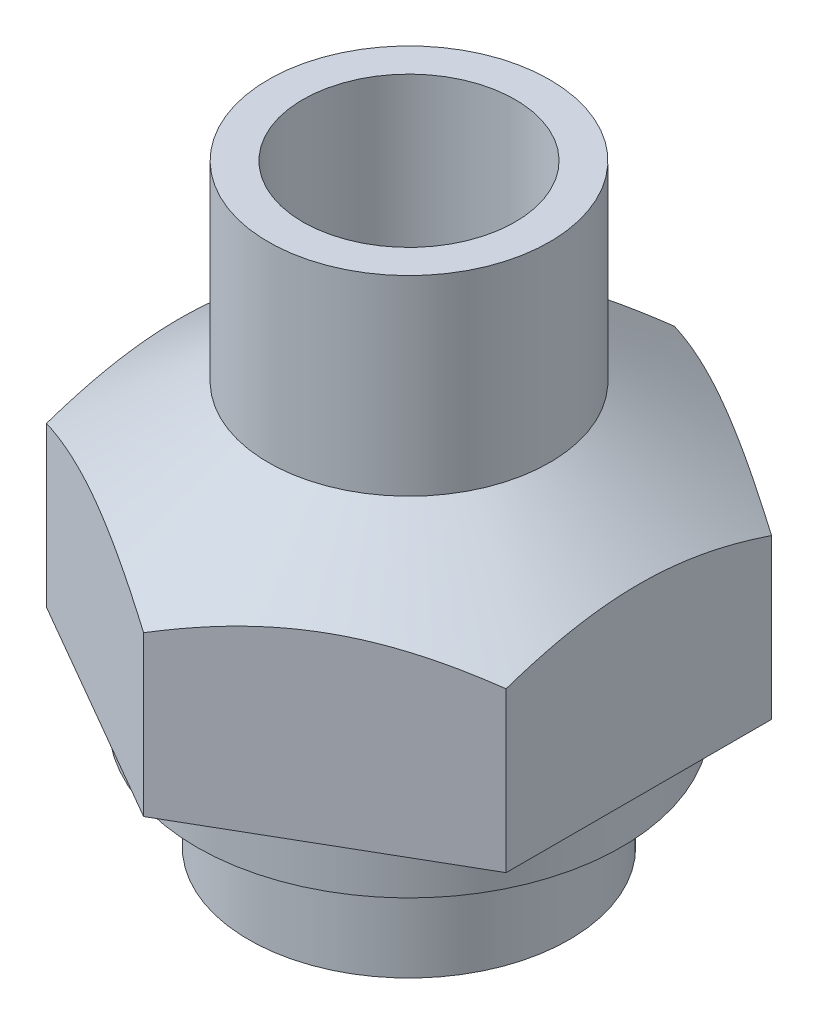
ISO-10303-21;
HEADER;
FILE_DESCRIPTION(('STEP AP214'),'2;1');
FILE_NAME('part.step','',(''),(''),'','','');
FILE_SCHEMA(('AUTOMOTIVE_DESIGN { 1 0 10303 214 1 1 1 1 }'));
ENDSEC;
DATA;
#1=APPLICATION_CONTEXT('core data for automotive mechanical design processes');
#2=APPLICATION_PROTOCOL_DEFINITION('international standard','automotive_design',2000,#1);
#3=PRODUCT_CONTEXT('',#1,'mechanical');
#4=PRODUCT('Part','Part','',(#3));
#5=PRODUCT_RELATED_PRODUCT_CATEGORY('part','',(#4));
#6=PRODUCT_DEFINITION_FORMATION('','',#4);
#7=PRODUCT_DEFINITION_CONTEXT('part definition',#1,'design');
#8=PRODUCT_DEFINITION('design','',#6,#7);
#9=PRODUCT_DEFINITION_SHAPE('','',#8);
#10=(LENGTH_UNIT() NAMED_UNIT(*) SI_UNIT(.MILLI.,.METRE.));
#11=(NAMED_UNIT(*) PLANE_ANGLE_UNIT() SI_UNIT($,.RADIAN.));
#12=(NAMED_UNIT(*) SI_UNIT($,.STERADIAN.) SOLID_ANGLE_UNIT());
#13=UNCERTAINTY_MEASURE_WITH_UNIT(LENGTH_MEASURE(1.E-05),#10,'distance_accuracy_value','');
#14=(GEOMETRIC_REPRESENTATION_CONTEXT(3) GLOBAL_UNCERTAINTY_ASSIGNED_CONTEXT((#13)) GLOBAL_UNIT_ASSIGNED_CONTEXT((#10,
#11,#12)) REPRESENTATION_CONTEXT('',''));
#15=CARTESIAN_POINT('',(0.,0.,0.));
#16=DIRECTION('',(0.,0.,1.));
#17=DIRECTION('',(1.,0.,0.));
#18=AXIS2_PLACEMENT_3D('',#15,#16,#17);
#19=CARTESIAN_POINT('',(0.,0.,0.));
#20=DIRECTION('',(0.,-1.,0.));
#21=DIRECTION('',(0.,0.,-1.));
#22=AXIS2_PLACEMENT_3D('',#19,#20,#21);
#23=CYLINDRICAL_SURFACE('',#22,14.);
#24=CARTESIAN_POINT('',(0.,8.,0.));
#25=DIRECTION('',(0.,-1.,0.));
#26=DIRECTION('',(0.,0.,-1.));
#27=AXIS2_PLACEMENT_3D('',#24,#25,#26);
#28=CIRCLE('',#27,14.);
#29=CARTESIAN_POINT('',(0.,8.,-14.));
#30=VERTEX_POINT('',#29);
#31=EDGE_CURVE('E277',#30,#30,#28,.F.);
#32=ORIENTED_EDGE('',*,*,#31,.T.);
#33=EDGE_LOOP('',(#32));
#34=FACE_BOUND('',#33,.T.);
#35=CARTESIAN_POINT('',(0.,10.,0.));
#36=DIRECTION('',(0.,-1.,0.));
#37=DIRECTION('',(0.,0.,-1.));
#38=AXIS2_PLACEMENT_3D('',#35,#36,#37);
#39=CIRCLE('',#38,14.);
#40=CARTESIAN_POINT('',(0.,10.,-14.));
#41=VERTEX_POINT('',#40);
#42=EDGE_CURVE('E19',#41,#41,#39,.T.);
#43=ORIENTED_EDGE('',*,*,#42,.T.);
#44=EDGE_LOOP('',(#43));
#45=FACE_BOUND('',#44,.T.);
#46=ADVANCED_FACE('F16',(#34,#45),#23,.T.);
#47=CARTESIAN_POINT('',(-14.,10.,0.));
#48=DIRECTION('',(0.,1.,0.));
#49=DIRECTION('',(0.,0.,1.));
#50=AXIS2_PLACEMENT_3D('',#47,#48,#49);
#51=PLANE('',#50);
#52=CARTESIAN_POINT('',(0.,10.,0.));
#53=DIRECTION('',(0.,-1.,0.));
#54=DIRECTION('',(0.,0.,-1.));
#55=AXIS2_PLACEMENT_3D('',#52,#53,#54);
#56=CIRCLE('',#55,20.);
#57=CARTESIAN_POINT('',(0.,10.,-20.));
#58=VERTEX_POINT('',#57);
#59=EDGE_CURVE('E275',#58,#58,#56,.F.);
#60=ORIENTED_EDGE('',*,*,#59,.F.);
#61=EDGE_LOOP('',(#60));
#62=FACE_BOUND('',#61,.T.);
#63=ORIENTED_EDGE('',*,*,#42,.F.);
#64=EDGE_LOOP('',(#63));
#65=FACE_BOUND('',#64,.T.);
#66=ADVANCED_FACE('F211',(#62,#65),#51,.F.);
#67=CARTESIAN_POINT('',(-15.1,8.,0.));
#68=DIRECTION('',(0.,-1.,0.));
#69=DIRECTION('',(0.,0.,-1.));
#70=AXIS2_PLACEMENT_3D('',#67,#68,#69);
#71=PLANE('',#70);
#72=ORIENTED_EDGE('',*,*,#31,.F.);
#73=EDGE_LOOP('',(#72));
#74=FACE_BOUND('',#73,.T.);
#75=CARTESIAN_POINT('',(0.,8.,0.));
#76=DIRECTION('',(0.,-1.,0.));
#77=DIRECTION('',(0.,0.,-1.));
#78=AXIS2_PLACEMENT_3D('',#75,#76,#77);
#79=CIRCLE('',#78,15.1);
#80=CARTESIAN_POINT('',(0.,8.,-15.1));
#81=VERTEX_POINT('',#80);
#82=EDGE_CURVE('E272',#81,#81,#79,.T.);
#83=ORIENTED_EDGE('',*,*,#82,.F.);
#84=EDGE_LOOP('',(#83));
#85=FACE_BOUND('',#84,.T.);
#86=ADVANCED_FACE('F208',(#74,#85),#71,.F.);
#87=CARTESIAN_POINT('',(0.,0.,0.));
#88=DIRECTION('',(0.,-1.,0.));
#89=DIRECTION('',(0.,0.,-1.));
#90=AXIS2_PLACEMENT_3D('',#87,#88,#89);
#91=CYLINDRICAL_SURFACE('',#90,20.);
#92=ORIENTED_EDGE('',*,*,#59,.T.);
#93=EDGE_LOOP('',(#92));
#94=FACE_BOUND('',#93,.T.);
#95=CARTESIAN_POINT('',(0.,15.,0.));
#96=DIRECTION('',(0.,-1.,0.));
#97=DIRECTION('',(0.,0.,-1.));
#98=AXIS2_PLACEMENT_3D('',#95,#96,#97);
#99=CIRCLE('',#98,20.);
#100=CARTESIAN_POINT('',(0.,15.,-20.));
#101=VERTEX_POINT('',#100);
#102=EDGE_CURVE('E269',#101,#101,#99,.T.);
#103=ORIENTED_EDGE('',*,*,#102,.T.);
#104=EDGE_LOOP('',(#103));
#105=FACE_BOUND('',#104,.T.);
#106=ADVANCED_FACE('F204',(#94,#105),#91,.T.);
#107=CARTESIAN_POINT('',(0.,0.,0.));
#108=DIRECTION('',(0.,-1.,0.));
#109=DIRECTION('',(0.,0.,-1.));
#110=AXIS2_PLACEMENT_3D('',#107,#108,#109);
#111=CYLINDRICAL_SURFACE('',#110,15.1);
#112=CARTESIAN_POINT('',(0.,0.,0.));
#113=DIRECTION('',(0.,-1.,0.));
#114=DIRECTION('',(0.,0.,-1.));
#115=AXIS2_PLACEMENT_3D('',#112,#113,#114);
#116=CIRCLE('',#115,15.1);
#117=CARTESIAN_POINT('',(0.,0.,-15.1));
#118=VERTEX_POINT('',#117);
#119=EDGE_CURVE('E266',#118,#118,#116,.F.);
#120=ORIENTED_EDGE('',*,*,#119,.T.);
#121=EDGE_LOOP('',(#120));
#122=FACE_BOUND('',#121,.T.);
#123=ORIENTED_EDGE('',*,*,#82,.T.);
#124=EDGE_LOOP('',(#123));
#125=FACE_BOUND('',#124,.T.);
#126=ADVANCED_FACE('F201',(#122,#125),#111,.T.);
#127=CARTESIAN_POINT('',(-20.,15.,0.));
#128=DIRECTION('',(0.,1.,0.));
#129=DIRECTION('',(0.,0.,1.));
#130=AXIS2_PLACEMENT_3D('',#127,#128,#129);
#131=PLANE('',#130);
#132=DIRECTION('',(0.866025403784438,0.,0.500000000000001));
#133=VECTOR('',#132,1.);
#134=CARTESIAN_POINT('',(0.,15.,25.));
#135=LINE('',#134,#133);
#136=CARTESIAN_POINT('',(-21.650635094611,15.,12.4999999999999));
#137=VERTEX_POINT('',#136);
#138=CARTESIAN_POINT('',(0.,15.,25.));
#139=VERTEX_POINT('',#138);
#140=EDGE_CURVE('E104',#137,#139,#135,.T.);
#141=ORIENTED_EDGE('',*,*,#140,.F.);
#142=DIRECTION('',(0.,0.,1.));
#143=VECTOR('',#142,1.);
#144=CARTESIAN_POINT('',(-21.650635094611,15.,12.4999999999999));
#145=LINE('',#144,#143);
#146=CARTESIAN_POINT('',(-21.6506350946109,15.,-12.5000000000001));
#147=VERTEX_POINT('',#146);
#148=EDGE_CURVE('E109',#147,#137,#145,.T.);
#149=ORIENTED_EDGE('',*,*,#148,.F.);
#150=DIRECTION('',(-0.866025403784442,0.,0.499999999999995));
#151=VECTOR('',#150,1.);
#152=CARTESIAN_POINT('',(-21.6506350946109,15.,-12.5000000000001));
#153=LINE('',#152,#151);
#154=CARTESIAN_POINT('',(1.74206827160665E-13,15.,-25.));
#155=VERTEX_POINT('',#154);
#156=EDGE_CURVE('E87',#155,#147,#153,.T.);
#157=ORIENTED_EDGE('',*,*,#156,.F.);
#158=DIRECTION('',(-0.866025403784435,0.,-0.500000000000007));
#159=VECTOR('',#158,1.);
#160=CARTESIAN_POINT('',(1.74574066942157E-13,15.,-25.));
#161=LINE('',#160,#159);
#162=CARTESIAN_POINT('',(21.6506350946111,15.,-12.4999999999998));
#163=VERTEX_POINT('',#162);
#164=EDGE_CURVE('E79',#163,#155,#161,.T.);
#165=ORIENTED_EDGE('',*,*,#164,.F.);
#166=DIRECTION('',(0.,0.,-1.));
#167=VECTOR('',#166,1.);
#168=CARTESIAN_POINT('',(21.6506350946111,15.,-12.4999999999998));
#169=LINE('',#168,#167);
#170=CARTESIAN_POINT('',(21.6506350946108,15.,12.5000000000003));
#171=VERTEX_POINT('',#170);
#172=EDGE_CURVE('E67',#171,#163,#169,.T.);
#173=ORIENTED_EDGE('',*,*,#172,.F.);
#174=DIRECTION('',(0.866025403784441,0.,-0.499999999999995));
#175=VECTOR('',#174,1.);
#176=CARTESIAN_POINT('',(21.6506350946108,15.,12.5000000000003));
#177=LINE('',#176,#175);
#178=EDGE_CURVE('E99',#139,#171,#177,.T.);
#179=ORIENTED_EDGE('',*,*,#178,.F.);
#180=EDGE_LOOP('',(#141,#149,#157,#165,#173,#179));
#181=FACE_BOUND('',#180,.T.);
#182=ORIENTED_EDGE('',*,*,#102,.F.);
#183=EDGE_LOOP('',(#182));
#184=FACE_BOUND('',#183,.T.);
#185=ADVANCED_FACE('F84',(#181,#184),#131,.F.);
#186=CARTESIAN_POINT('',(0.,0.,0.));
#187=DIRECTION('',(0.,1.,0.));
#188=DIRECTION('',(0.,0.,1.));
#189=AXIS2_PLACEMENT_3D('',#186,#187,#188);
#190=PLANE('',#189);
#191=ORIENTED_EDGE('',*,*,#119,.F.);
#192=EDGE_LOOP('',(#191));
#193=FACE_BOUND('',#192,.T.);
#194=CARTESIAN_POINT('',(0.,0.,0.));
#195=DIRECTION('',(0.,-1.,0.));
#196=DIRECTION('',(0.,0.,-1.));
#197=AXIS2_PLACEMENT_3D('',#194,#195,#196);
#198=CIRCLE('',#197,11.);
#199=CARTESIAN_POINT('',(0.,0.,-11.));
#200=VERTEX_POINT('',#199);
#201=EDGE_CURVE('E89',#200,#200,#198,.F.);
#202=ORIENTED_EDGE('',*,*,#201,.T.);
#203=EDGE_LOOP('',(#202));
#204=FACE_BOUND('',#203,.T.);
#205=ADVANCED_FACE('F194',(#193,#204),#190,.F.);
#206=CARTESIAN_POINT('',(-21.6506350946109,45.,-12.5000000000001));
#207=DIRECTION('',(-0.499999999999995,0.,-0.866025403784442));
#208=DIRECTION('',(-0.866025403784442,0.,0.499999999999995));
#209=AXIS2_PLACEMENT_3D('',#206,#207,#208);
#210=PLANE('',#209);
#211=ORIENTED_EDGE('',*,*,#156,.T.);
#212=DIRECTION('',(0.,1.,0.));
#213=VECTOR('',#212,1.);
#214=CARTESIAN_POINT('',(-21.6506350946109,45.,-12.5000000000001));
#215=LINE('',#214,#213);
#216=CARTESIAN_POINT('',(-21.6506350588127,30.0000000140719,-12.5000000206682));
#217=VERTEX_POINT('',#216);
#218=EDGE_CURVE('E111',#217,#147,#215,.F.);
#219=ORIENTED_EDGE('',*,*,#218,.F.);
#220=CARTESIAN_POINT('',(1.1179479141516E-13,30.,-25.));
#221=CARTESIAN_POINT('',(-0.241893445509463,30.0950837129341,-24.8603427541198));
#222=CARTESIAN_POINT('',(-0.484415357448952,30.1880283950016,-24.7203226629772));
#223=CARTESIAN_POINT('',(-0.970728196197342,30.3693135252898,-24.4395498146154));
#224=CARTESIAN_POINT('',(-1.21451903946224,30.4576542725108,-24.2987971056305));
#225=CARTESIAN_POINT('',(-1.94811192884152,30.7153879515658,-23.8752570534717));
#226=CARTESIAN_POINT('',(-2.4398854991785,30.8773938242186,-23.5913314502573));
#227=CARTESIAN_POINT('',(-3.43032328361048,31.1794377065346,-23.0195019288));
#228=CARTESIAN_POINT('',(-3.92900554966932,31.3193971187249,-22.7315875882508));
#229=CARTESIAN_POINT('',(-4.93122843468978,31.5737487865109,-22.1529539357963));
#230=CARTESIAN_POINT('',(-5.43476860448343,31.6881433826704,-21.8622348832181));
#231=CARTESIAN_POINT('',(-6.42868892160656,31.8851412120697,-21.288394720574));
#232=CARTESIAN_POINT('',(-6.91892568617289,31.9687029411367,-21.005356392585));
#233=CARTESIAN_POINT('',(-7.90246060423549,32.1072377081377,-20.4375122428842));
#234=CARTESIAN_POINT('',(-8.39575884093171,32.1622099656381,-20.1527063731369));
#235=CARTESIAN_POINT('',(-9.38329231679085,32.2419216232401,-19.5825536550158));
#236=CARTESIAN_POINT('',(-9.87752420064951,32.2667160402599,-19.2972087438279));
#237=CARTESIAN_POINT('',(-10.8664139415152,32.2855049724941,-18.7262729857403));
#238=CARTESIAN_POINT('',(-11.3610717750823,32.2795010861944,-18.4406821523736));
#239=CARTESIAN_POINT('',(-12.2664003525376,32.2404718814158,-17.9179904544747));
#240=CARTESIAN_POINT('',(-12.6772296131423,32.2121521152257,-17.6807980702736));
#241=CARTESIAN_POINT('',(-13.4974190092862,32.1349203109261,-17.2072615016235));
#242=CARTESIAN_POINT('',(-13.9067791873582,32.0860088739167,-16.9709172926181));
#243=CARTESIAN_POINT('',(-14.7238964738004,31.9684649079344,-16.4991544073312));
#244=CARTESIAN_POINT('',(-15.131650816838,31.8998069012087,-16.2637373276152));
#245=CARTESIAN_POINT('',(-15.9444880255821,31.7440348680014,-15.7944455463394));
#246=CARTESIAN_POINT('',(-16.349570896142,31.6569208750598,-15.5605708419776));
#247=CARTESIAN_POINT('',(-17.5842624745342,31.3643069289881,-14.8477213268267));
#248=CARTESIAN_POINT('',(-18.4089594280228,31.1311622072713,-14.3715823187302));
#249=CARTESIAN_POINT('',(-20.0418644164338,30.6062567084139,-13.42882418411));
#250=CARTESIAN_POINT('',(-20.8501121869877,30.31466204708,-12.9621821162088));
#251=CARTESIAN_POINT('',(-21.6506350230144,30.0000000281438,-12.5000000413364));
#252=B_SPLINE_CURVE_WITH_KNOTS('',3,(#220,#221,#222,#223,#224,#225,#226,#227,#228,#229,#230,
#231,#232,#233,#234,#235,#236,#237,#238,#239,#240,#241,#242,#243,#244,#245,#246,#247,#248,#249,
#250,#251),.UNSPECIFIED.,.F.,.F.,(4,2,2,2,2,2,2,2,2,2,2,2,2,2,2,4),(0.,0.885148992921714,
1.77024042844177,3.54133406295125,5.31860546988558,7.09571409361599,8.81167213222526,
10.5276770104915,12.2405487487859,13.9533315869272,15.3785734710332,16.8037737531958,
18.2308211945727,19.6578660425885,22.5967828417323,25.5274626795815),.UNSPECIFIED.);
#253=CARTESIAN_POINT('',(1.14054863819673E-13,30.,-25.));
#254=VERTEX_POINT('',#253);
#255=EDGE_CURVE('E179',#254,#217,#252,.T.);
#256=ORIENTED_EDGE('',*,*,#255,.F.);
#257=DIRECTION('',(0.,1.,0.));
#258=VECTOR('',#257,1.);
#259=CARTESIAN_POINT('',(1.74574066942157E-13,45.,-25.));
#260=LINE('',#259,#258);
#261=EDGE_CURVE('E33',#155,#254,#260,.T.);
#262=ORIENTED_EDGE('',*,*,#261,.F.);
#263=EDGE_LOOP('',(#211,#219,#256,#262));
#264=FACE_BOUND('',#263,.T.);
#265=ADVANCED_FACE('F189',(#264),#210,.T.);
#266=CARTESIAN_POINT('',(-21.650635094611,45.,12.4999999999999));
#267=DIRECTION('',(-1.,0.,0.));
#268=DIRECTION('',(0.,0.,1.));
#269=AXIS2_PLACEMENT_3D('',#266,#267,#268);
#270=PLANE('',#269);
#271=ORIENTED_EDGE('',*,*,#148,.T.);
#272=DIRECTION('',(0.,1.,0.));
#273=VECTOR('',#272,1.);
#274=CARTESIAN_POINT('',(-21.650635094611,45.,12.4999999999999));
#275=LINE('',#274,#273);
#276=CARTESIAN_POINT('',(-21.650635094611,30.0000000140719,12.4999999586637));
#277=VERTEX_POINT('',#276);
#278=EDGE_CURVE('E106',#277,#137,#275,.F.);
#279=ORIENTED_EDGE('',*,*,#278,.F.);
#280=CARTESIAN_POINT('',(-21.6506350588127,29.9999999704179,-12.500000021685));
#281=CARTESIAN_POINT('',(-21.6506350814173,30.0950836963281,-12.2206855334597));
#282=CARTESIAN_POINT('',(-21.6506350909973,30.1880283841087,-11.940645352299));
#283=CARTESIAN_POINT('',(-21.6506350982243,30.3693135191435,-11.3790996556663));
#284=CARTESIAN_POINT('',(-21.650635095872,30.4576542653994,-11.0975942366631));
#285=CARTESIAN_POINT('',(-21.6506350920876,30.7153879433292,-10.2505141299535));
#286=CARTESIAN_POINT('',(-21.6506350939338,30.8773938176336,-9.68266292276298));
#287=CARTESIAN_POINT('',(-21.6506350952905,31.1794377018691,-8.53900387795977));
#288=CARTESIAN_POINT('',(-21.6506350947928,31.3193971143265,-7.96317519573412));
#289=CARTESIAN_POINT('',(-21.6506350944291,31.5737487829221,-6.80590788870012));
#290=CARTESIAN_POINT('',(-21.650635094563,31.6881433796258,-6.22446978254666));
#291=CARTESIAN_POINT('',(-21.6506350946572,31.8851412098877,-5.07678945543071));
#292=CARTESIAN_POINT('',(-21.6506350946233,31.9687029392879,-4.51071279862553));
#293=CARTESIAN_POINT('',(-21.6506350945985,32.1072377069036,-3.37502449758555));
#294=CARTESIAN_POINT('',(-21.6506350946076,32.1622099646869,-2.80541275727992));
#295=CARTESIAN_POINT('',(-21.6506350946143,32.2419216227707,-1.66510731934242));
#296=CARTESIAN_POINT('',(-21.6506350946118,32.2667160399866,-1.09441749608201));
#297=CARTESIAN_POINT('',(-21.6506350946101,32.2855049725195,0.0474540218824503));
#298=CARTESIAN_POINT('',(-21.6506350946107,32.2795010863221,0.618635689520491));
#299=CARTESIAN_POINT('',(-21.6506350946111,32.2404718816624,1.66401908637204));
#300=CARTESIAN_POINT('',(-21.650635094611,32.2121521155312,2.13840385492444));
#301=CARTESIAN_POINT('',(-21.6506350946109,32.1349203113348,3.08547699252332));
#302=CARTESIAN_POINT('',(-21.650635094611,32.0860088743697,3.5581654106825));
#303=CARTESIAN_POINT('',(-21.650635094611,31.9684649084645,4.50169118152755));
#304=CARTESIAN_POINT('',(-21.650635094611,31.8998069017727,4.9725253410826));
#305=CARTESIAN_POINT('',(-21.650635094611,31.7440348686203,5.911108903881));
#306=CARTESIAN_POINT('',(-21.650635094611,31.6569208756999,6.37885831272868));
#307=CARTESIAN_POINT('',(-21.650635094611,31.3643069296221,7.80455734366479));
#308=CARTESIAN_POINT('',(-21.650635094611,31.1311622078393,8.75683536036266));
#309=CARTESIAN_POINT('',(-21.650635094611,30.6062567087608,10.6423516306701));
#310=CARTESIAN_POINT('',(-21.650635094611,30.3146620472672,11.5756357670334));
#311=CARTESIAN_POINT('',(-21.650635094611,30.0000000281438,12.4999999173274));
#312=B_SPLINE_CURVE_WITH_KNOTS('',3,(#280,#281,#282,#283,#284,#285,#286,#287,#288,#289,#290,
#291,#292,#293,#294,#295,#296,#297,#298,#299,#300,#301,#302,#303,#304,#305,#306,#307,#308,#309,
#310,#311),.UNSPECIFIED.,.F.,.F.,(4,2,2,2,2,2,2,2,2,2,2,2,2,2,2,4),(0.,0.885148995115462,
1.77024043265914,3.54133407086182,5.31860548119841,7.0957141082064,8.81167214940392,
10.527677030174,12.2405487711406,13.9533316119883,15.3785734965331,16.8037737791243,
18.2308212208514,19.6578660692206,22.5967828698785,25.5274627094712),.UNSPECIFIED.);
#313=EDGE_CURVE('E173',#217,#277,#312,.T.);
#314=ORIENTED_EDGE('',*,*,#313,.F.);
#315=ORIENTED_EDGE('',*,*,#218,.T.);
#316=EDGE_LOOP('',(#271,#279,#314,#315));
#317=FACE_BOUND('',#316,.T.);
#318=ADVANCED_FACE('F186',(#317),#270,.T.);
#319=CARTESIAN_POINT('',(0.,45.,25.));
#320=DIRECTION('',(-0.500000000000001,0.,0.866025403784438));
#321=DIRECTION('',(0.866025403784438,0.,0.500000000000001));
#322=AXIS2_PLACEMENT_3D('',#319,#320,#321);
#323=PLANE('',#322);
#324=ORIENTED_EDGE('',*,*,#140,.T.);
#325=DIRECTION('',(0.,1.,0.));
#326=VECTOR('',#325,1.);
#327=CARTESIAN_POINT('',(0.,45.,25.));
#328=LINE('',#327,#326);
#329=CARTESIAN_POINT('',(0.,30.,25.));
#330=VERTEX_POINT('',#329);
#331=EDGE_CURVE('E101',#330,#139,#328,.F.);
#332=ORIENTED_EDGE('',*,*,#331,.F.);
#333=CARTESIAN_POINT('',(-21.6506350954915,29.9999999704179,12.4999999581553));
#334=CARTESIAN_POINT('',(-21.408741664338,30.0950836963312,12.6396572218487));
#335=CARTESIAN_POINT('',(-21.1662197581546,30.1880283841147,12.77967732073));
#336=CARTESIAN_POINT('',(-20.6799069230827,30.369313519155,13.0604501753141));
#337=CARTESIAN_POINT('',(-20.4361160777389,30.4576542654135,13.2012028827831));
#338=CARTESIAN_POINT('',(-19.702523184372,30.7153879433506,13.6247429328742));
#339=CARTESIAN_POINT('',(-19.2107496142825,30.8773938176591,13.9086685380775));
#340=CARTESIAN_POINT('',(-18.2203118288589,31.1794377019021,14.480498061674));
#341=CARTESIAN_POINT('',(-17.7216295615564,31.3193971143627,14.7684124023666));
#342=CARTESIAN_POINT('',(-16.7194066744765,31.5737487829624,15.3470460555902));
#343=CARTESIAN_POINT('',(-16.2158665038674,31.6881433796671,15.6377651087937));
#344=CARTESIAN_POINT('',(-15.2219461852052,31.8851412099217,16.2116052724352));
#345=CARTESIAN_POINT('',(-14.7317094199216,31.9687029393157,16.4946436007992));
#346=CARTESIAN_POINT('',(-13.7481745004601,32.1072377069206,17.0624877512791));
#347=CARTESIAN_POINT('',(-13.2548762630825,32.1622099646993,17.3472936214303));
#348=CARTESIAN_POINT('',(-12.2673427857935,32.2419216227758,17.9174463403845));
#349=CARTESIAN_POINT('',(-11.7731109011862,32.266716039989,18.2027912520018));
#350=CARTESIAN_POINT('',(-10.7842211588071,32.2855049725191,18.7737270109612));
#351=CARTESIAN_POINT('',(-10.2895633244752,32.2795010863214,19.0593178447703));
#352=CARTESIAN_POINT('',(-9.38423474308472,32.2404718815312,19.5820095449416));
#353=CARTESIAN_POINT('',(-8.97340547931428,32.2121521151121,19.8192019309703));
#354=CARTESIAN_POINT('',(-8.15321607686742,32.1349203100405,20.2927385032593));
#355=CARTESIAN_POINT('',(-7.74385589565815,32.086008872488,20.5290827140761));
#356=CARTESIAN_POINT('',(-6.92673860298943,31.9684649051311,21.0008456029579));
#357=CARTESIAN_POINT('',(-6.51898425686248,31.8998068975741,21.2362626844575));
#358=CARTESIAN_POINT('',(-5.7061470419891,31.7440348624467,21.705554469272));
#359=CARTESIAN_POINT('',(-5.30106416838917,31.6569208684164,21.939429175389));
#360=CARTESIAN_POINT('',(-4.06637258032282,31.3643069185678,22.6522786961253));
#361=CARTESIAN_POINT('',(-3.24167562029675,31.1311621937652,23.1284177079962));
#362=CARTESIAN_POINT('',(-1.60877061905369,30.6062566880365,24.071175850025));
#363=CARTESIAN_POINT('',(-0.80052284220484,30.3146620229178,24.5378179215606));
#364=CARTESIAN_POINT('',(0.,30.,25.));
#365=B_SPLINE_CURVE_WITH_KNOTS('',3,(#333,#334,#335,#336,#337,#338,#339,#340,#341,#342,#343,
#344,#345,#346,#347,#348,#349,#350,#351,#352,#353,#354,#355,#356,#357,#358,#359,#360,#361,#362,
#363,#364),.UNSPECIFIED.,.F.,.F.,(4,2,2,2,2,2,2,2,2,2,2,2,2,2,2,4),(0.,0.88514899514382,
1.77024043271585,3.54133407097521,5.31860548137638,7.09571410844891,8.81167214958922,
10.5276770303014,12.240548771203,13.9533316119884,15.3785735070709,16.8037738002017,
18.2308212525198,19.6578661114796,22.5967829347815,25.5274627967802),.UNSPECIFIED.);
#366=EDGE_CURVE('E167',#277,#330,#365,.T.);
#367=ORIENTED_EDGE('',*,*,#366,.F.);
#368=ORIENTED_EDGE('',*,*,#278,.T.);
#369=EDGE_LOOP('',(#324,#332,#367,#368));
#370=FACE_BOUND('',#369,.T.);
#371=ADVANCED_FACE('F157',(#370),#323,.T.);
#372=CARTESIAN_POINT('',(21.6506350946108,45.,12.5000000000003));
#373=DIRECTION('',(0.499999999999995,0.,0.866025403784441));
#374=DIRECTION('',(0.866025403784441,0.,-0.499999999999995));
#375=AXIS2_PLACEMENT_3D('',#372,#373,#374);
#376=PLANE('',#375);
#377=ORIENTED_EDGE('',*,*,#178,.T.);
#378=DIRECTION('',(0.,1.,0.));
#379=VECTOR('',#378,1.);
#380=CARTESIAN_POINT('',(21.6506350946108,45.,12.5000000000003));
#381=LINE('',#380,#379);
#382=CARTESIAN_POINT('',(21.6506350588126,30.0000000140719,12.5000000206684));
#383=VERTEX_POINT('',#382);
#384=EDGE_CURVE('E73',#383,#171,#381,.F.);
#385=ORIENTED_EDGE('',*,*,#384,.F.);
#386=CARTESIAN_POINT('',(0.,30.,25.));
#387=CARTESIAN_POINT('',(0.241893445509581,30.0950837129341,24.8603427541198));
#388=CARTESIAN_POINT('',(0.484415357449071,30.1880283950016,24.7203226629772));
#389=CARTESIAN_POINT('',(0.970728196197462,30.3693135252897,24.4395498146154));
#390=CARTESIAN_POINT('',(1.21451903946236,30.4576542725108,24.2987971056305));
#391=CARTESIAN_POINT('',(1.94811192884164,30.7153879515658,23.8752570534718));
#392=CARTESIAN_POINT('',(2.43988549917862,30.8773938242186,23.5913314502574));
#393=CARTESIAN_POINT('',(3.43032328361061,31.1794377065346,23.0195019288));
#394=CARTESIAN_POINT('',(3.92900554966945,31.3193971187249,22.7315875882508));
#395=CARTESIAN_POINT('',(4.93122843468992,31.5737487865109,22.1529539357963));
#396=CARTESIAN_POINT('',(5.43476860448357,31.6881433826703,21.8622348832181));
#397=CARTESIAN_POINT('',(6.4286889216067,31.8851412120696,21.2883947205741));
#398=CARTESIAN_POINT('',(6.91892568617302,31.9687029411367,21.005356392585));
#399=CARTESIAN_POINT('',(7.90246060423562,32.1072377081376,20.4375122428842));
#400=CARTESIAN_POINT('',(8.39575884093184,32.162209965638,20.1527063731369));
#401=CARTESIAN_POINT('',(9.38329231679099,32.24192162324,19.5825536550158));
#402=CARTESIAN_POINT('',(9.87752420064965,32.2667160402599,19.297208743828));
#403=CARTESIAN_POINT('',(10.8664139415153,32.285504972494,18.7262729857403));
#404=CARTESIAN_POINT('',(11.3610717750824,32.2795010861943,18.4406821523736));
#405=CARTESIAN_POINT('',(12.2664003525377,32.2404718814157,17.9179904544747));
#406=CARTESIAN_POINT('',(12.6772296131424,32.2121521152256,17.6807980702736));
#407=CARTESIAN_POINT('',(13.4974190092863,32.1349203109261,17.2072615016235));
#408=CARTESIAN_POINT('',(13.9067791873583,32.0860088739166,16.9709172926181));
#409=CARTESIAN_POINT('',(14.7238964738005,31.9684649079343,16.4991544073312));
#410=CARTESIAN_POINT('',(15.1316508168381,31.8998069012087,16.2637373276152));
#411=CARTESIAN_POINT('',(15.9444880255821,31.7440348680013,15.7944455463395));
#412=CARTESIAN_POINT('',(16.3495708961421,31.6569208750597,15.5605708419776));
#413=CARTESIAN_POINT('',(17.5842624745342,31.3643069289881,14.8477213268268));
#414=CARTESIAN_POINT('',(18.4089594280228,31.1311622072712,14.3715823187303));
#415=CARTESIAN_POINT('',(20.0418644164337,30.6062567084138,13.4288241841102));
#416=CARTESIAN_POINT('',(20.8501121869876,30.31466204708,12.962182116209));
#417=CARTESIAN_POINT('',(21.6506350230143,30.0000000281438,12.5000000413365));
#418=B_SPLINE_CURVE_WITH_KNOTS('',3,(#386,#387,#388,#389,#390,#391,#392,#393,#394,#395,#396,
#397,#398,#399,#400,#401,#402,#403,#404,#405,#406,#407,#408,#409,#410,#411,#412,#413,#414,#415,
#416,#417),.UNSPECIFIED.,.F.,.F.,(4,2,2,2,2,2,2,2,2,2,2,2,2,2,2,4),(0.,0.885148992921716,
1.77024042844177,3.54133406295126,5.31860546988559,7.095714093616,8.81167213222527,
10.5276770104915,12.240548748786,13.9533315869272,15.3785734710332,16.8037737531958,
18.2308211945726,19.6578660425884,22.5967828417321,25.5274626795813),.UNSPECIFIED.);
#419=EDGE_CURVE('E161',#330,#383,#418,.T.);
#420=ORIENTED_EDGE('',*,*,#419,.F.);
#421=ORIENTED_EDGE('',*,*,#331,.T.);
#422=EDGE_LOOP('',(#377,#385,#420,#421));
#423=FACE_BOUND('',#422,.T.);
#424=ADVANCED_FACE('F153',(#423),#376,.T.);
#425=CARTESIAN_POINT('',(21.6506350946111,45.,-12.4999999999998));
#426=DIRECTION('',(1.,0.,0.));
#427=DIRECTION('',(0.,0.,-1.));
#428=AXIS2_PLACEMENT_3D('',#425,#426,#427);
#429=PLANE('',#428);
#430=ORIENTED_EDGE('',*,*,#172,.T.);
#431=DIRECTION('',(0.,1.,0.));
#432=VECTOR('',#431,1.);
#433=CARTESIAN_POINT('',(21.6506350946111,45.,-12.4999999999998));
#434=LINE('',#433,#432);
#435=CARTESIAN_POINT('',(21.6506350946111,30.0000000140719,-12.4999999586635));
#436=VERTEX_POINT('',#435);
#437=EDGE_CURVE('E71',#436,#163,#434,.F.);
#438=ORIENTED_EDGE('',*,*,#437,.F.);
#439=CARTESIAN_POINT('',(21.6506350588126,29.9999999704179,12.5000000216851));
#440=CARTESIAN_POINT('',(21.6506350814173,30.0950836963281,12.2206855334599));
#441=CARTESIAN_POINT('',(21.6506350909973,30.1880283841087,11.9406453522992));
#442=CARTESIAN_POINT('',(21.6506350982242,30.3693135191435,11.3790996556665));
#443=CARTESIAN_POINT('',(21.6506350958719,30.4576542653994,11.0975942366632));
#444=CARTESIAN_POINT('',(21.6506350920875,30.7153879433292,10.2505141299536));
#445=CARTESIAN_POINT('',(21.6506350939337,30.8773938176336,9.68266292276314));
#446=CARTESIAN_POINT('',(21.6506350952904,31.1794377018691,8.53900387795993));
#447=CARTESIAN_POINT('',(21.6506350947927,31.3193971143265,7.96317519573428));
#448=CARTESIAN_POINT('',(21.650635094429,31.5737487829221,6.80590788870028));
#449=CARTESIAN_POINT('',(21.650635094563,31.6881433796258,6.22446978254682));
#450=CARTESIAN_POINT('',(21.6506350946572,31.8851412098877,5.07678945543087));
#451=CARTESIAN_POINT('',(21.6506350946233,31.9687029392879,4.51071279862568));
#452=CARTESIAN_POINT('',(21.6506350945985,32.1072377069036,3.37502449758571));
#453=CARTESIAN_POINT('',(21.6506350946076,32.1622099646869,2.80541275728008));
#454=CARTESIAN_POINT('',(21.6506350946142,32.2419216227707,1.66510731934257));
#455=CARTESIAN_POINT('',(21.6506350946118,32.2667160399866,1.09441749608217));
#456=CARTESIAN_POINT('',(21.6506350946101,32.2855049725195,-0.0474540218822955));
#457=CARTESIAN_POINT('',(21.6506350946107,32.279501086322,-0.618635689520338));
#458=CARTESIAN_POINT('',(21.6506350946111,32.2404718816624,-1.66401908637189));
#459=CARTESIAN_POINT('',(21.650635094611,32.2121521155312,-2.13840385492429));
#460=CARTESIAN_POINT('',(21.6506350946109,32.1349203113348,-3.08547699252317));
#461=CARTESIAN_POINT('',(21.650635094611,32.0860088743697,-3.55816541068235));
#462=CARTESIAN_POINT('',(21.650635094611,31.9684649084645,-4.50169118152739));
#463=CARTESIAN_POINT('',(21.650635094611,31.8998069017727,-4.97252534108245));
#464=CARTESIAN_POINT('',(21.650635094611,31.7440348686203,-5.91110890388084));
#465=CARTESIAN_POINT('',(21.650635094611,31.6569208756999,-6.37885831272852));
#466=CARTESIAN_POINT('',(21.650635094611,31.3643069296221,-7.80455734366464));
#467=CARTESIAN_POINT('',(21.650635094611,31.1311622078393,-8.75683536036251));
#468=CARTESIAN_POINT('',(21.6506350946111,30.6062567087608,-10.6423516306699));
#469=CARTESIAN_POINT('',(21.6506350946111,30.3146620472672,-11.5756357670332));
#470=CARTESIAN_POINT('',(21.6506350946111,30.0000000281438,-12.4999999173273));
#471=B_SPLINE_CURVE_WITH_KNOTS('',3,(#439,#440,#441,#442,#443,#444,#445,#446,#447,#448,#449,
#450,#451,#452,#453,#454,#455,#456,#457,#458,#459,#460,#461,#462,#463,#464,#465,#466,#467,#468,
#469,#470),.UNSPECIFIED.,.F.,.F.,(4,2,2,2,2,2,2,2,2,2,2,2,2,2,2,4),(0.,0.88514899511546,
1.77024043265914,3.54133407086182,5.31860548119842,7.0957141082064,8.81167214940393,
10.527677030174,12.2405487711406,13.9533316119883,15.3785734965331,16.8037737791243,
18.2308212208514,19.6578660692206,22.5967828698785,25.5274627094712),.UNSPECIFIED.);
#472=EDGE_CURVE('E136',#383,#436,#471,.T.);
#473=ORIENTED_EDGE('',*,*,#472,.F.);
#474=ORIENTED_EDGE('',*,*,#384,.T.);
#475=EDGE_LOOP('',(#430,#438,#473,#474));
#476=FACE_BOUND('',#475,.T.);
#477=ADVANCED_FACE('F69',(#476),#429,.T.);
#478=CARTESIAN_POINT('',(1.74574066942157E-13,45.,-25.));
#479=DIRECTION('',(0.500000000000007,0.,-0.866025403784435));
#480=DIRECTION('',(-0.866025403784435,0.,-0.500000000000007));
#481=AXIS2_PLACEMENT_3D('',#478,#479,#480);
#482=PLANE('',#481);
#483=ORIENTED_EDGE('',*,*,#164,.T.);
#484=ORIENTED_EDGE('',*,*,#261,.T.);
#485=CARTESIAN_POINT('',(21.6506350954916,29.9999999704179,-12.4999999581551));
#486=CARTESIAN_POINT('',(21.4087416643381,30.0950836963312,-12.6396572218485));
#487=CARTESIAN_POINT('',(21.1662197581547,30.1880283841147,-12.7796773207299));
#488=CARTESIAN_POINT('',(20.6799069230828,30.369313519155,-13.0604501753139));
#489=CARTESIAN_POINT('',(20.436116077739,30.4576542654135,-13.201202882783));
#490=CARTESIAN_POINT('',(19.7025231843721,30.7153879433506,-13.6247429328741));
#491=CARTESIAN_POINT('',(19.2107496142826,30.8773938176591,-13.9086685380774));
#492=CARTESIAN_POINT('',(18.220311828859,31.1794377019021,-14.4804980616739));
#493=CARTESIAN_POINT('',(17.7216295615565,31.3193971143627,-14.7684124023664));
#494=CARTESIAN_POINT('',(16.7194066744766,31.5737487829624,-15.34704605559));
#495=CARTESIAN_POINT('',(16.2158665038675,31.6881433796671,-15.6377651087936));
#496=CARTESIAN_POINT('',(15.2219461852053,31.8851412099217,-16.2116052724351));
#497=CARTESIAN_POINT('',(14.7317094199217,31.9687029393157,-16.4946436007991));
#498=CARTESIAN_POINT('',(13.7481745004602,32.1072377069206,-17.062487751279));
#499=CARTESIAN_POINT('',(13.2548762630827,32.1622099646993,-17.3472936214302));
#500=CARTESIAN_POINT('',(12.2673427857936,32.2419216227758,-17.9174463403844));
#501=CARTESIAN_POINT('',(11.7731109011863,32.266716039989,-18.2027912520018));
#502=CARTESIAN_POINT('',(10.7842211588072,32.2855049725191,-18.7737270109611));
#503=CARTESIAN_POINT('',(10.2895633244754,32.2795010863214,-19.0593178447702));
#504=CARTESIAN_POINT('',(9.38423474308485,32.2404718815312,-19.5820095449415));
#505=CARTESIAN_POINT('',(8.97340547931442,32.2121521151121,-19.8192019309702));
#506=CARTESIAN_POINT('',(8.15321607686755,32.1349203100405,-20.2927385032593));
#507=CARTESIAN_POINT('',(7.74385589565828,32.086008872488,-20.529082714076));
#508=CARTESIAN_POINT('',(6.92673860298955,31.9684649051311,-21.0008456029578));
#509=CARTESIAN_POINT('',(6.51898425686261,31.8998068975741,-21.2362626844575));
#510=CARTESIAN_POINT('',(5.70614704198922,31.7440348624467,-21.705554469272));
#511=CARTESIAN_POINT('',(5.30106416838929,31.6569208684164,-21.939429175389));
#512=CARTESIAN_POINT('',(4.06637258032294,31.3643069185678,-22.6522786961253));
#513=CARTESIAN_POINT('',(3.24167562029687,31.1311621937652,-23.1284177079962));
#514=CARTESIAN_POINT('',(1.60877061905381,30.6062566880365,-24.071175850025));
#515=CARTESIAN_POINT('',(0.800522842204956,30.3146620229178,-24.5378179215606));
#516=CARTESIAN_POINT('',(1.14731027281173E-13,30.,-25.));
#517=B_SPLINE_CURVE_WITH_KNOTS('',3,(#485,#486,#487,#488,#489,#490,#491,#492,#493,#494,#495,
#496,#497,#498,#499,#500,#501,#502,#503,#504,#505,#506,#507,#508,#509,#510,#511,#512,#513,#514,
#515,#516),.UNSPECIFIED.,.F.,.F.,(4,2,2,2,2,2,2,2,2,2,2,2,2,2,2,4),(0.,0.885148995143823,
1.77024043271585,3.54133407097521,5.31860548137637,7.0957141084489,8.81167214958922,
10.5276770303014,12.240548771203,13.9533316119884,15.3785735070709,16.8037738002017,
18.2308212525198,19.6578661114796,22.5967829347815,25.5274627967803),.UNSPECIFIED.);
#518=EDGE_CURVE('E81',#436,#254,#517,.T.);
#519=ORIENTED_EDGE('',*,*,#518,.F.);
#520=ORIENTED_EDGE('',*,*,#437,.T.);
#521=EDGE_LOOP('',(#483,#484,#519,#520));
#522=FACE_BOUND('',#521,.T.);
#523=ADVANCED_FACE('F78',(#522),#482,.T.);
#524=CARTESIAN_POINT('',(0.,5.,0.));
#525=DIRECTION('',(0.,-1.,0.));
#526=DIRECTION('',(0.,0.,-1.));
#527=AXIS2_PLACEMENT_3D('',#524,#525,#526);
#528=CYLINDRICAL_SURFACE('',#527,11.);
#529=ORIENTED_EDGE('',*,*,#201,.F.);
#530=EDGE_LOOP('',(#529));
#531=FACE_BOUND('',#530,.T.);
#532=CARTESIAN_POINT('',(0.,5.,0.));
#533=DIRECTION('',(0.,-1.,0.));
#534=DIRECTION('',(0.,0.,-1.));
#535=AXIS2_PLACEMENT_3D('',#532,#533,#534);
#536=CIRCLE('',#535,11.);
#537=CARTESIAN_POINT('',(0.,5.,-11.));
#538=VERTEX_POINT('',#537);
#539=EDGE_CURVE('E126',#538,#538,#536,.T.);
#540=ORIENTED_EDGE('',*,*,#539,.F.);
#541=EDGE_LOOP('',(#540));
#542=FACE_BOUND('',#541,.T.);
#543=ADVANCED_FACE('F149',(#531,#542),#528,.F.);
#544=CARTESIAN_POINT('',(0.,29.952,0.));
#545=DIRECTION('',(0.,-1.,0.));
#546=DIRECTION('',(1.,0.,0.));
#547=AXIS2_PLACEMENT_3D('',#544,#545,#546);
#548=CONICAL_SURFACE('',#547,25.0705,0.973037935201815);
#549=ORIENTED_EDGE('',*,*,#366,.T.);
#550=ORIENTED_EDGE('',*,*,#419,.T.);
#551=ORIENTED_EDGE('',*,*,#472,.T.);
#552=ORIENTED_EDGE('',*,*,#518,.T.);
#553=ORIENTED_EDGE('',*,*,#255,.T.);
#554=ORIENTED_EDGE('',*,*,#313,.T.);
#555=EDGE_LOOP('',(#549,#550,#551,#552,#553,#554));
#556=FACE_BOUND('',#555,.T.);
#557=CARTESIAN_POINT('',(0.,38.,0.));
#558=DIRECTION('',(0.,-1.,0.));
#559=DIRECTION('',(0.,0.,-1.));
#560=AXIS2_PLACEMENT_3D('',#557,#558,#559);
#561=CIRCLE('',#560,13.25);
#562=CARTESIAN_POINT('',(0.,38.,-13.25));
#563=VERTEX_POINT('',#562);
#564=EDGE_CURVE('E125',#563,#563,#561,.F.);
#565=ORIENTED_EDGE('',*,*,#564,.F.);
#566=EDGE_LOOP('',(#565));
#567=FACE_BOUND('',#566,.T.);
#568=ADVANCED_FACE('F143',(#556,#567),#548,.T.);
#569=CARTESIAN_POINT('',(0.,5.,0.));
#570=DIRECTION('',(0.,-1.,0.));
#571=DIRECTION('',(0.,0.,-1.));
#572=AXIS2_PLACEMENT_3D('',#569,#570,#571);
#573=PLANE('',#572);
#574=CARTESIAN_POINT('',(0.,5.,0.));
#575=DIRECTION('',(0.,1.,0.));
#576=DIRECTION('',(0.,0.,1.));
#577=AXIS2_PLACEMENT_3D('',#574,#575,#576);
#578=CIRCLE('',#577,10.5);
#579=CARTESIAN_POINT('',(0.,5.,10.5));
#580=VERTEX_POINT('',#579);
#581=EDGE_CURVE('E122',#580,#580,#578,.T.);
#582=ORIENTED_EDGE('',*,*,#581,.T.);
#583=EDGE_LOOP('',(#582));
#584=FACE_BOUND('',#583,.T.);
#585=ORIENTED_EDGE('',*,*,#539,.T.);
#586=EDGE_LOOP('',(#585));
#587=FACE_BOUND('',#586,.T.);
#588=ADVANCED_FACE('F245',(#584,#587),#573,.T.);
#589=CARTESIAN_POINT('',(0.,0.,0.));
#590=DIRECTION('',(0.,-1.,0.));
#591=DIRECTION('',(0.,0.,-1.));
#592=AXIS2_PLACEMENT_3D('',#589,#590,#591);
#593=CYLINDRICAL_SURFACE('',#592,13.25);
#594=ORIENTED_EDGE('',*,*,#564,.T.);
#595=EDGE_LOOP('',(#594));
#596=FACE_BOUND('',#595,.T.);
#597=CARTESIAN_POINT('',(0.,56.,0.));
#598=DIRECTION('',(0.,-1.,0.));
#599=DIRECTION('',(0.,0.,-1.));
#600=AXIS2_PLACEMENT_3D('',#597,#598,#599);
#601=CIRCLE('',#600,13.25);
#602=CARTESIAN_POINT('',(0.,56.,-13.25));
#603=VERTEX_POINT('',#602);
#604=EDGE_CURVE('E119',#603,#603,#601,.T.);
#605=ORIENTED_EDGE('',*,*,#604,.T.);
#606=EDGE_LOOP('',(#605));
#607=FACE_BOUND('',#606,.T.);
#608=ADVANCED_FACE('F242',(#596,#607),#593,.T.);
#609=CARTESIAN_POINT('',(0.,28.,0.));
#610=DIRECTION('',(0.,1.,0.));
#611=DIRECTION('',(0.,0.,1.));
#612=AXIS2_PLACEMENT_3D('',#609,#610,#611);
#613=CYLINDRICAL_SURFACE('',#612,10.5);
#614=ORIENTED_EDGE('',*,*,#581,.F.);
#615=EDGE_LOOP('',(#614));
#616=FACE_BOUND('',#615,.T.);
#617=CARTESIAN_POINT('',(0.,28.,0.));
#618=DIRECTION('',(0.,1.,0.));
#619=DIRECTION('',(0.,0.,1.));
#620=AXIS2_PLACEMENT_3D('',#617,#618,#619);
#621=CIRCLE('',#620,10.5);
#622=CARTESIAN_POINT('',(0.,28.,10.5));
#623=VERTEX_POINT('',#622);
#624=EDGE_CURVE('E116',#623,#623,#621,.T.);
#625=ORIENTED_EDGE('',*,*,#624,.T.);
#626=EDGE_LOOP('',(#625));
#627=FACE_BOUND('',#626,.T.);
#628=ADVANCED_FACE('F238',(#616,#627),#613,.F.);
#629=CARTESIAN_POINT('',(0.,56.,0.));
#630=DIRECTION('',(0.,-1.,0.));
#631=DIRECTION('',(0.,0.,-1.));
#632=AXIS2_PLACEMENT_3D('',#629,#630,#631);
#633=PLANE('',#632);
#634=ORIENTED_EDGE('',*,*,#604,.F.);
#635=EDGE_LOOP('',(#634));
#636=FACE_BOUND('',#635,.T.);
#637=CARTESIAN_POINT('',(0.,56.,0.));
#638=DIRECTION('',(0.,1.,0.));
#639=DIRECTION('',(0.,0.,1.));
#640=AXIS2_PLACEMENT_3D('',#637,#638,#639);
#641=CIRCLE('',#640,10.);
#642=CARTESIAN_POINT('',(0.,56.,10.));
#643=VERTEX_POINT('',#642);
#644=EDGE_CURVE('E25',#643,#643,#641,.F.);
#645=ORIENTED_EDGE('',*,*,#644,.T.);
#646=EDGE_LOOP('',(#645));
#647=FACE_BOUND('',#646,.T.);
#648=ADVANCED_FACE('F230',(#636,#647),#633,.F.);
#649=CARTESIAN_POINT('',(10.5,28.,0.));
#650=DIRECTION('',(0.,1.,0.));
#651=DIRECTION('',(0.,0.,1.));
#652=AXIS2_PLACEMENT_3D('',#649,#650,#651);
#653=PLANE('',#652);
#654=ORIENTED_EDGE('',*,*,#624,.F.);
#655=EDGE_LOOP('',(#654));
#656=FACE_BOUND('',#655,.T.);
#657=CARTESIAN_POINT('',(0.,28.,0.));
#658=DIRECTION('',(0.,1.,0.));
#659=DIRECTION('',(0.,0.,1.));
#660=AXIS2_PLACEMENT_3D('',#657,#658,#659);
#661=CIRCLE('',#660,10.);
#662=CARTESIAN_POINT('',(0.,28.,10.));
#663=VERTEX_POINT('',#662);
#664=EDGE_CURVE('E11',#663,#663,#661,.T.);
#665=ORIENTED_EDGE('',*,*,#664,.T.);
#666=EDGE_LOOP('',(#665));
#667=FACE_BOUND('',#666,.T.);
#668=ADVANCED_FACE('F224',(#656,#667),#653,.F.);
#669=CARTESIAN_POINT('',(0.,28.,0.));
#670=DIRECTION('',(0.,1.,0.));
#671=DIRECTION('',(0.,0.,1.));
#672=AXIS2_PLACEMENT_3D('',#669,#670,#671);
#673=CYLINDRICAL_SURFACE('',#672,10.);
#674=ORIENTED_EDGE('',*,*,#644,.F.);
#675=EDGE_LOOP('',(#674));
#676=FACE_BOUND('',#675,.T.);
#677=ORIENTED_EDGE('',*,*,#664,.F.);
#678=EDGE_LOOP('',(#677));
#679=FACE_BOUND('',#678,.T.);
#680=ADVANCED_FACE('F222',(#676,#679),#673,.F.);
#681=CLOSED_SHELL('',(#46,#66,#86,#106,#126,#185,#205,#265,#318,#371,#424,#477,#523,#543,#568,
#588,#608,#628,#648,#668,#680));
#682=MANIFOLD_SOLID_BREP('B1',#681);
#683=ADVANCED_BREP_SHAPE_REPRESENTATION('',(#18,#682),#14);
#684=SHAPE_DEFINITION_REPRESENTATION(#9,#683);
ENDSEC;
END-ISO-10303-21;
